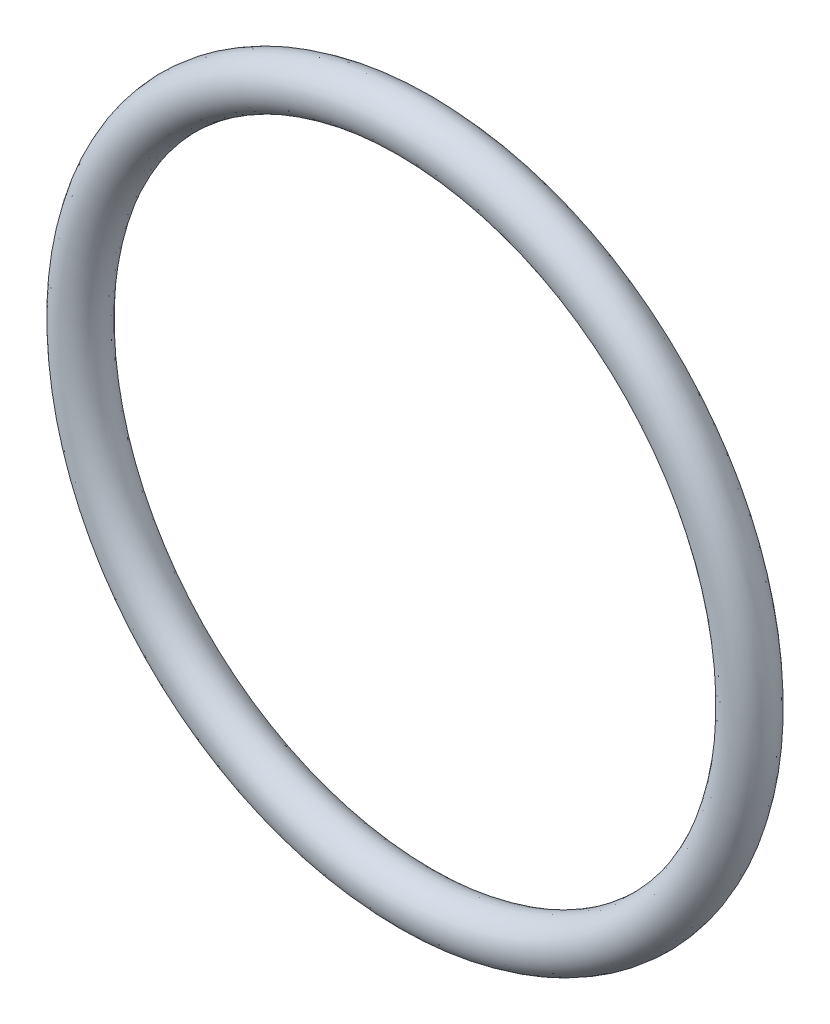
ISO-10303-21;
HEADER;
FILE_DESCRIPTION(('STEP AP214'),'2;1');
FILE_NAME('part.step','',(''),(''),'','','');
FILE_SCHEMA(('AUTOMOTIVE_DESIGN { 1 0 10303 214 1 1 1 1 }'));
ENDSEC;
DATA;
#1=APPLICATION_CONTEXT('core data for automotive mechanical design processes');
#2=APPLICATION_PROTOCOL_DEFINITION('international standard','automotive_design',2000,#1);
#3=PRODUCT_CONTEXT('',#1,'mechanical');
#4=PRODUCT('Part','Part','',(#3));
#5=PRODUCT_RELATED_PRODUCT_CATEGORY('part','',(#4));
#6=PRODUCT_DEFINITION_FORMATION('','',#4);
#7=PRODUCT_DEFINITION_CONTEXT('part definition',#1,'design');
#8=PRODUCT_DEFINITION('design','',#6,#7);
#9=PRODUCT_DEFINITION_SHAPE('','',#8);
#10=(LENGTH_UNIT() NAMED_UNIT(*) SI_UNIT(.MILLI.,.METRE.));
#11=(NAMED_UNIT(*) PLANE_ANGLE_UNIT() SI_UNIT($,.RADIAN.));
#12=(NAMED_UNIT(*) SI_UNIT($,.STERADIAN.) SOLID_ANGLE_UNIT());
#13=UNCERTAINTY_MEASURE_WITH_UNIT(LENGTH_MEASURE(1.E-05),#10,'distance_accuracy_value','');
#14=(GEOMETRIC_REPRESENTATION_CONTEXT(3) GLOBAL_UNCERTAINTY_ASSIGNED_CONTEXT((#13)) GLOBAL_UNIT_ASSIGNED_CONTEXT((#10,
#11,#12)) REPRESENTATION_CONTEXT('',''));
#15=CARTESIAN_POINT('',(0.,0.,0.));
#16=DIRECTION('',(0.,0.,1.));
#17=DIRECTION('',(1.,0.,0.));
#18=AXIS2_PLACEMENT_3D('',#15,#16,#17);
#19=CARTESIAN_POINT('',(0.,18.6450000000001,-1.31000000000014));
#20=DIRECTION('',(1.,0.,0.));
#21=DIRECTION('',(0.,1.,0.));
#22=AXIS2_PLACEMENT_3D('',#19,#20,#21);
#23=ELLIPSE('',#22,1.35,1.31);
#24=CARTESIAN_POINT('',(0.,-1.11022302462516E-13,0.));
#25=DIRECTION('',(0.,0.,1.));
#26=AXIS1_PLACEMENT('',#24,#25);
#27=SURFACE_OF_REVOLUTION('',#23,#26);
#28=ADVANCED_FACE('F29',(),#27,.T.);
#29=CLOSED_SHELL('',(#28));
#30=MANIFOLD_SOLID_BREP('B2',#29);
#31=ADVANCED_BREP_SHAPE_REPRESENTATION('',(#18,#30),#14);
#32=SHAPE_DEFINITION_REPRESENTATION(#9,#31);
ENDSEC;
END-ISO-10303-21;
